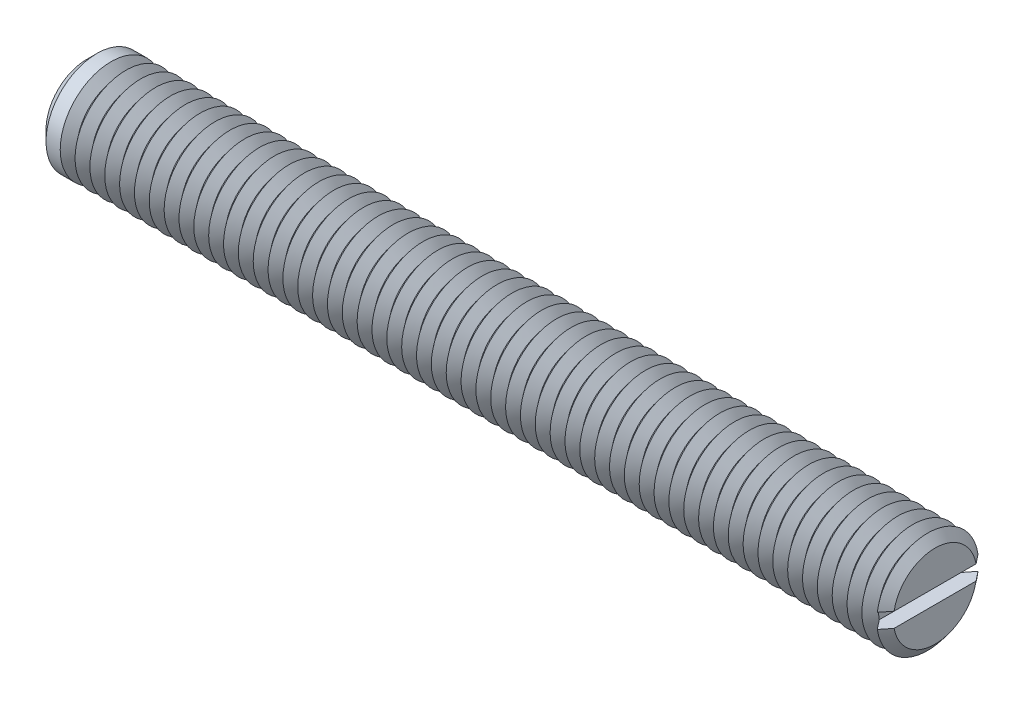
from build123d import *

# Parameters (mm, degrees)
SKETCH1_R       = 6
EXTRUDE1_DEPTH  = 50
SKETCH2_W       = 1.75
SKETCH2_H       = 1.75
EXTRUDE2_DEPTH  = 9
CHAMFER1_SIZE   = 1.2
LPATTERN1_COUNT = 56
LPATTERN1_PITCH = 1.75


with BuildPart() as part:
    # Sketch1 → Extrude1 (new, symmetric)
    with BuildSketch(Plane(origin=(0, 0, 0), x_dir=(0, 0, -1), z_dir=(1, 0, 0))):
        Circle(SKETCH1_R)
    extrude(amount=EXTRUDE1_DEPTH, both=True)

    # Sketch2 → Extrude2 (cut, symmetric)
    with BuildSketch(Plane.XY):
        with Locations((49.125, 0)):
            Rectangle(SKETCH2_W, SKETCH2_H)
    extrude(amount=EXTRUDE2_DEPTH, both=True, mode=Mode.SUBTRACT)

    # Chamfer1
    chamfer1_edges = [part.edges().sort_by_distance(p)[0] for p in [
        (-50, 0, 6),
    ]]
    chamfer(chamfer1_edges, length=CHAMFER1_SIZE)

    # Sketch3 → Cut-Revolve1 (revolve, cut)
    with BuildSketch(Plane.XY, mode=Mode.PRIVATE) as cut_revolve1_sk:
        Polygon((49.125, -6), (50.875, -6), (50, -4.90712535), align=None)
    cut_revolve1 = revolve(cut_revolve1_sk.sketch.rotate(Axis((0, 0, 0), (1, 0, 0)), 261.614461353), axis=Axis((0, 0, 0), (1, 0, 0)), mode=Mode.SUBTRACT)

    # LPattern1: Cut-Revolve1 ×56
    with Locations(*[(-i * LPATTERN1_PITCH, 0, 0) for i in range(1, LPATTERN1_COUNT)]):
        add(cut_revolve1, mode=Mode.SUBTRACT)


solid = part.part
